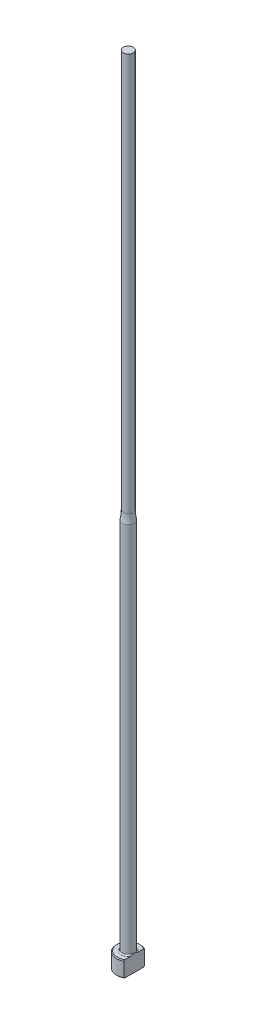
from build123d import *
from build123d.topology import SkipClean

# Parameters (mm, degrees)
CHAMFER1_SIZE    = 0.2
FILLET1_R        = 0.3
KEYED_HEAD_DEPTH = 201.044994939


with BuildPart() as part:
    # Sketch1 → Revolve1 (revolve)
    with BuildSketch(Plane.XY, mode=Mode.PRIVATE) as revolve1_sk:
        with BuildLine():
            Line((0, 0), (-3, 0))
            Line((-3, 0), (-3, 4))
            Line((-3, 4), (-1.5, 4))
            Line((-1.5, 4), (-1.5, 97.777951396))
            ThreePointArc((-1.5, 97.777951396), (-1.312696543, 98.881966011), (-1.25, 100))
            Line((-1.25, 100), (-1.25, 200))
            Line((-1.25, 200), (0, 200))
            Line((0, 200), (0, 0))
        make_face()
    revolve(revolve1_sk.sketch.rotate(Axis((0, 259.958771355, 0), (0, -1, 0)), 270), axis=Axis((0, 259.958771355, 0), (0, -1, 0)))

    # Chamfer1
    chamfer1_edges = [part.edges().sort_by_distance(p)[0] for p in [
        (0, 0, -3),
        (0, 4, -3),
    ]]
    chamfer(chamfer1_edges, length=CHAMFER1_SIZE)

    # Fillet1
    fillet1_edges = [part.edges().sort_by_distance(p)[0] for p in [
        (0, 4, -1.5),
    ]]
    fillet(fillet1_edges, radius=FILLET1_R)

    # Sketch2 → Keyed Head (cut, through all)
    with SkipClean():  # the faces are left unmerged after this step: merging them gives an invalid solid
        with BuildSketch(Plane(origin=(0, 0, 0), x_dir=(1, 0, 0), z_dir=(0, 1, 0))):
            with BuildLine():
                Line((1.5, -2.598076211), (1.5, 2.598076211))
                ThreePointArc((1.5, 2.598076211), (3, 0), (1.5, -2.598076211))
            make_face()
        extrude(amount=KEYED_HEAD_DEPTH, mode=Mode.SUBTRACT)


solid = part.part
